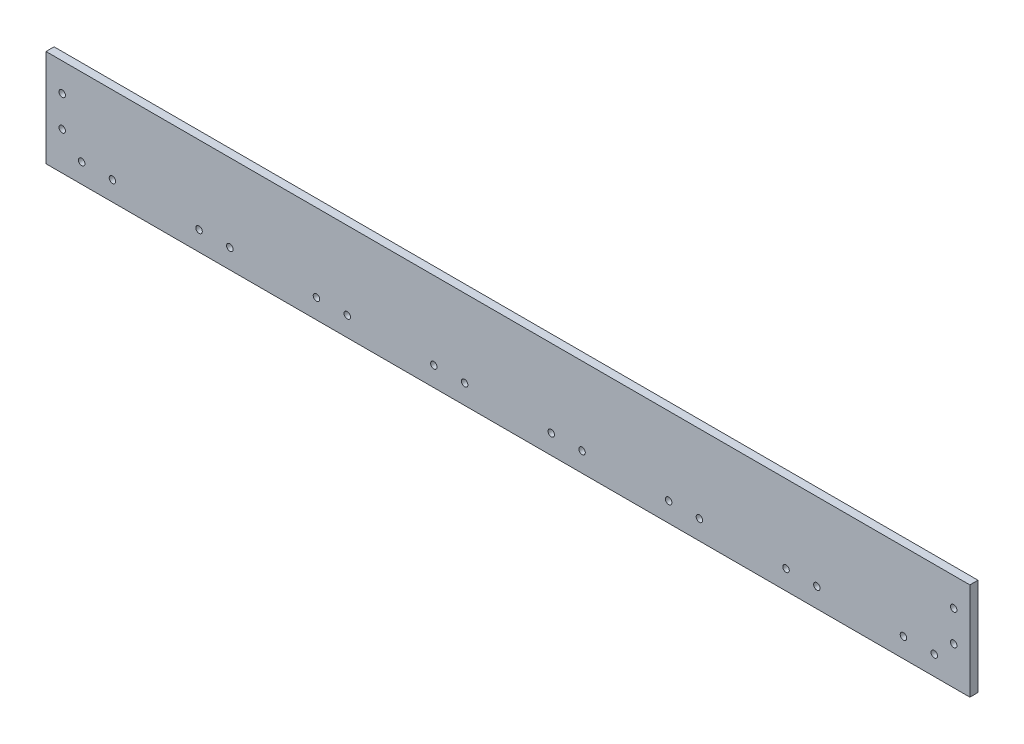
from build123d import *

# Parameters (mm, degrees)
SKETCH1_W           = 723.9
SKETCH1_H           = 76.2
BOSS_EXTRUDE1_DEPTH = 6.35
SKETCH2_R           = 2.54
CUT_EXTRUDE1_DEPTH  = 6.35
SKETCH3_R           = 2.54
CUT_EXTRUDE2_DEPTH  = 6.35
LPATTERN2_COUNT     = 8
LPATTERN2_PITCH     = 91.984285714


with BuildPart() as part:
    # Sketch1 → Boss-Extrude1 (new body)
    with BuildSketch(Plane.XY):
        with Locations((361.95, 38.1)):
            Rectangle(SKETCH1_W, SKETCH1_H)
    extrude(amount=BOSS_EXTRUDE1_DEPTH)

    # Sketch2 → Cut-Extrude1 (cut)
    with BuildSketch(Plane.XY.offset(6.35)):
        with Locations((27.94, 15.24)):
            Circle(SKETCH2_R)
        with Locations((52.07, 15.24)):
            Circle(SKETCH2_R)
    cut_extrude1 = extrude(amount=-CUT_EXTRUDE1_DEPTH, mode=Mode.SUBTRACT)

    # Sketch3 → Cut-Extrude2 (cut)
    with BuildSketch(Plane.XY.offset(6.35)):
        with Locations((12.7, 29.845)):
            Circle(SKETCH3_R)
        with Locations((12.7, 53.975)):
            Circle(SKETCH3_R)
        with Locations((711.2, 29.845)):
            Circle(SKETCH3_R)
        with Locations((711.2, 53.975)):
            Circle(SKETCH3_R)
    extrude(amount=-CUT_EXTRUDE2_DEPTH, mode=Mode.SUBTRACT)

    # LPattern2: Cut-Extrude1 ×8
    with Locations(*[(i * LPATTERN2_PITCH, 0, 0) for i in range(1, LPATTERN2_COUNT)]):
        add(cut_extrude1, mode=Mode.SUBTRACT)


solid = part.part
